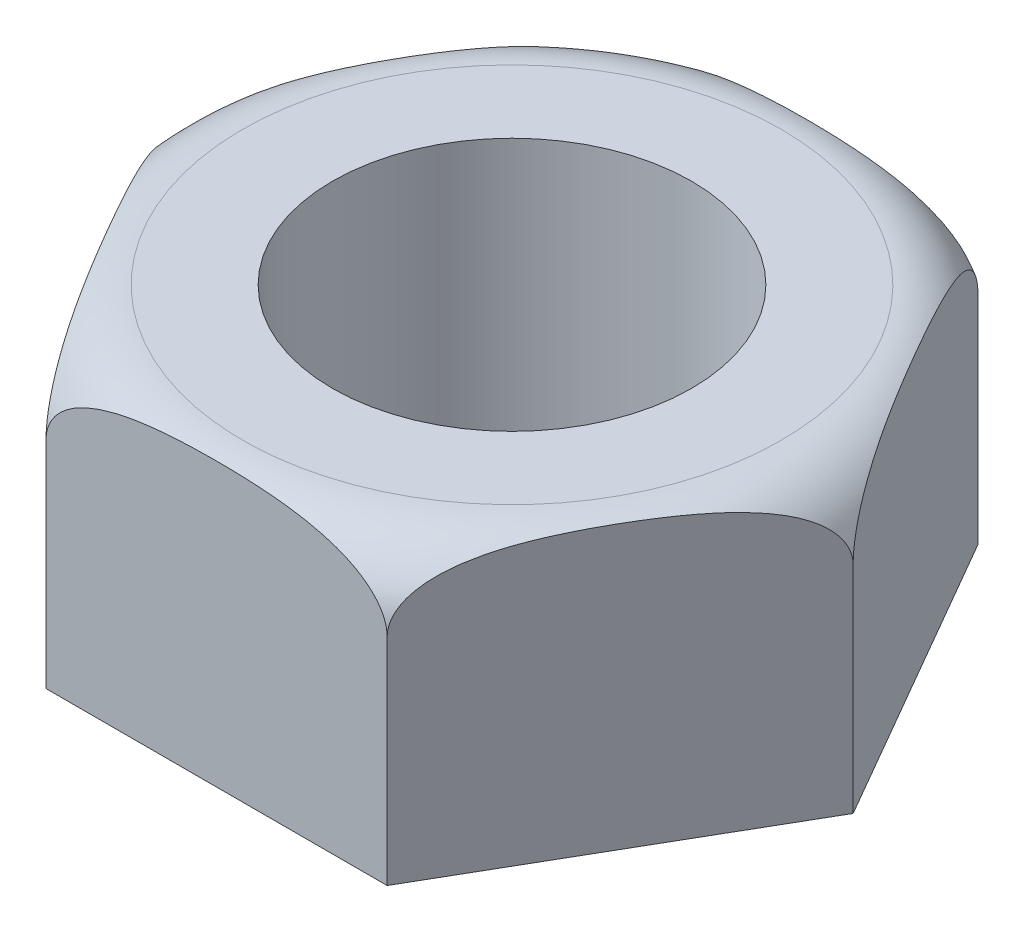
from build123d import *

# Parameters (mm, degrees)
SKETCH1_R      = 5
EXTRUDE1_DEPTH = 8


with BuildPart() as part:
    # Sketch1 → Extrude1 (new body)
    with BuildSketch(Plane(origin=(0, 0, 0), x_dir=(1, 0, 0), z_dir=(0, 1, 0))):
        Polygon((9.5, 0), (4.75, 8.227241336), (-4.75, 8.227241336), (-9.5, 0), (-4.75, -8.227241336), (4.75, -8.227241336), align=None)
        with Locations(Location((0, 0, 0), (0, 0, 270))):
            Circle(SKETCH1_R, mode=Mode.SUBTRACT)
    extrude(amount=EXTRUDE1_DEPTH)

    # Sketch2 → Cut-Revolve1 (revolve, cut)
    with BuildSketch(Plane.XY, mode=Mode.PRIVATE) as cut_revolve1_sk:
        with BuildLine():
            Line((4.75, 8), (7.5, 8))
            ThreePointArc((7.5, 8), (8.914213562, 7.414213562), (9.5, 6))
            Line((9.5, 6), (10.938866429, 6))
            Line((10.938866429, 6), (10.938866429, 9.623720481))
            Line((10.938866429, 9.623720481), (4.75, 9.623720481))
            Line((4.75, 9.623720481), (4.75, 8))
        make_face()
    revolve(cut_revolve1_sk.sketch.rotate(Axis((0, -2.317269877, 0), (0, 1, 0)), 90), axis=Axis((0, -2.317269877, 0), (0, 1, 0)), mode=Mode.SUBTRACT)


solid = part.part
